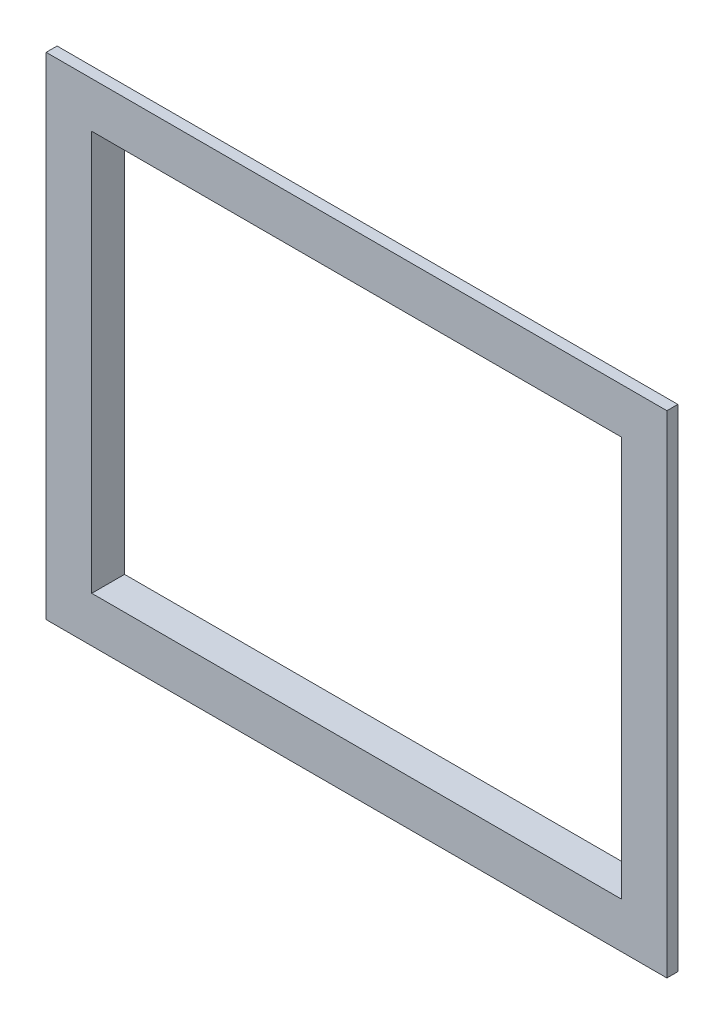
from build123d import *

# Parameters (mm, degrees)
ESQUISSE6_W        = 68.1
ESQUISSE6_H        = 53.9
ESQUISSE6_W_2      = 58.1
ESQUISSE6_H_2      = 43.9
BOSS_EXTRU_3_DEPTH = 1.2
ESQUISSE7_W        = 61.1
ESQUISSE7_H        = 46.9
ESQUISSE7_W_2      = 58.1
ESQUISSE7_H_2      = 43.9
BOSS_EXTRU_4_DEPTH = 2.4
CONG_1_R           = 0.6


with BuildPart() as part:
    # Esquisse6 → Boss.-Extru.3 (new body)
    with BuildSketch(Plane.XY):
        Rectangle(ESQUISSE6_W, ESQUISSE6_H)
        Rectangle(ESQUISSE6_W_2, ESQUISSE6_H_2, mode=Mode.SUBTRACT)
    extrude(amount=BOSS_EXTRU_3_DEPTH)

    # Esquisse7 → Boss.-Extru.4 (add)
    with BuildSketch(Plane(origin=(0, 0, 0), x_dir=(-1, 0, 0), z_dir=(0, 0, -1))):
        Rectangle(ESQUISSE7_W, ESQUISSE7_H)
        Rectangle(ESQUISSE7_W_2, ESQUISSE7_H_2, mode=Mode.SUBTRACT)
    extrude(amount=BOSS_EXTRU_4_DEPTH)

    # Cong_1
    cong_1_edges = [part.edges().sort_by_distance(p)[0] for p in [
        (-30.55, 23.45, -1.2),
        (30.55, 23.45, -1.2),
        (30.55, -23.45, -1.2),
        (-30.55, -23.45, -1.2),
    ]]
    fillet(cong_1_edges, radius=CONG_1_R)


solid = part.part
